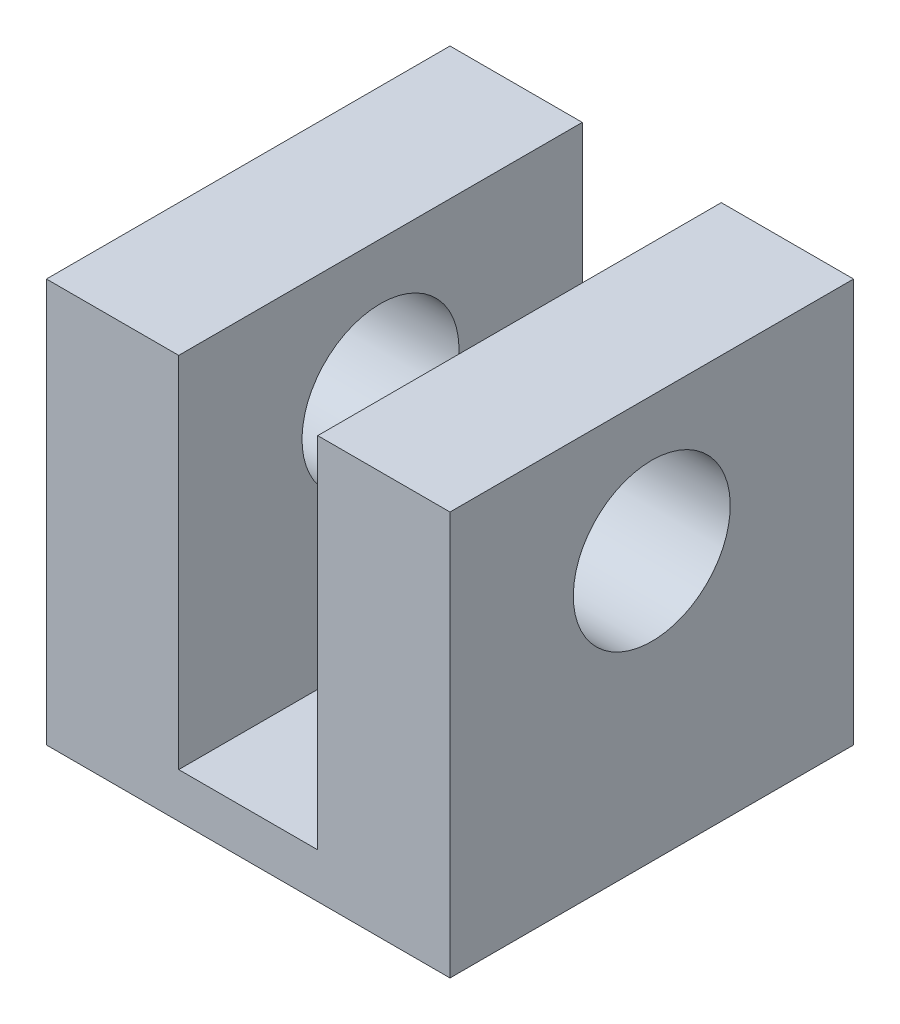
ISO-10303-21;
HEADER;
FILE_DESCRIPTION(('STEP AP214'),'2;1');
FILE_NAME('part.step','',(''),(''),'','','');
FILE_SCHEMA(('AUTOMOTIVE_DESIGN { 1 0 10303 214 1 1 1 1 }'));
ENDSEC;
DATA;
#1=APPLICATION_CONTEXT('core data for automotive mechanical design processes');
#2=APPLICATION_PROTOCOL_DEFINITION('international standard','automotive_design',2000,#1);
#3=PRODUCT_CONTEXT('',#1,'mechanical');
#4=PRODUCT('Part','Part','',(#3));
#5=PRODUCT_RELATED_PRODUCT_CATEGORY('part','',(#4));
#6=PRODUCT_DEFINITION_FORMATION('','',#4);
#7=PRODUCT_DEFINITION_CONTEXT('part definition',#1,'design');
#8=PRODUCT_DEFINITION('design','',#6,#7);
#9=PRODUCT_DEFINITION_SHAPE('','',#8);
#10=(LENGTH_UNIT() NAMED_UNIT(*) SI_UNIT(.MILLI.,.METRE.));
#11=(NAMED_UNIT(*) PLANE_ANGLE_UNIT() SI_UNIT($,.RADIAN.));
#12=(NAMED_UNIT(*) SI_UNIT($,.STERADIAN.) SOLID_ANGLE_UNIT());
#13=UNCERTAINTY_MEASURE_WITH_UNIT(LENGTH_MEASURE(1.E-05),#10,'distance_accuracy_value','');
#14=(GEOMETRIC_REPRESENTATION_CONTEXT(3) GLOBAL_UNCERTAINTY_ASSIGNED_CONTEXT((#13)) GLOBAL_UNIT_ASSIGNED_CONTEXT((#10,
#11,#12)) REPRESENTATION_CONTEXT('',''));
#15=CARTESIAN_POINT('',(0.,0.,0.));
#16=DIRECTION('',(0.,0.,1.));
#17=DIRECTION('',(1.,0.,0.));
#18=AXIS2_PLACEMENT_3D('',#15,#16,#17);
#19=CARTESIAN_POINT('',(-45.,89.9999999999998,90.));
#20=DIRECTION('',(1.,0.,0.));
#21=DIRECTION('',(0.,1.,0.));
#22=AXIS2_PLACEMENT_3D('',#19,#20,#21);
#23=PLANE('',#22);
#24=DIRECTION('',(0.,-1.,0.));
#25=VECTOR('',#24,1.);
#26=CARTESIAN_POINT('',(-45.,89.9999999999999,0.));
#27=LINE('',#26,#25);
#28=CARTESIAN_POINT('',(-45.,89.9999999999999,0.));
#29=VERTEX_POINT('',#28);
#30=CARTESIAN_POINT('',(-45.,0.,0.));
#31=VERTEX_POINT('',#30);
#32=EDGE_CURVE('E132',#29,#31,#27,.T.);
#33=ORIENTED_EDGE('',*,*,#32,.T.);
#34=DIRECTION('',(0.,0.,-1.));
#35=VECTOR('',#34,1.);
#36=CARTESIAN_POINT('',(-45.,0.,90.));
#37=LINE('',#36,#35);
#38=CARTESIAN_POINT('',(-45.,0.,90.));
#39=VERTEX_POINT('',#38);
#40=EDGE_CURVE('E40',#39,#31,#37,.T.);
#41=ORIENTED_EDGE('',*,*,#40,.F.);
#42=DIRECTION('',(0.,-1.,0.));
#43=VECTOR('',#42,1.);
#44=CARTESIAN_POINT('',(-45.,89.9999999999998,90.));
#45=LINE('',#44,#43);
#46=CARTESIAN_POINT('',(-45.,89.9999999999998,90.));
#47=VERTEX_POINT('',#46);
#48=EDGE_CURVE('E91',#47,#39,#45,.T.);
#49=ORIENTED_EDGE('',*,*,#48,.F.);
#50=DIRECTION('',(0.,0.,-1.));
#51=VECTOR('',#50,1.);
#52=CARTESIAN_POINT('',(-45.,89.9999999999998,90.));
#53=LINE('',#52,#51);
#54=EDGE_CURVE('E11',#47,#29,#53,.T.);
#55=ORIENTED_EDGE('',*,*,#54,.T.);
#56=EDGE_LOOP('',(#33,#41,#49,#55));
#57=FACE_BOUND('',#56,.T.);
#58=CARTESIAN_POINT('',(-45.,60.,45.));
#59=DIRECTION('',(1.,0.,0.));
#60=DIRECTION('',(0.,1.,0.));
#61=AXIS2_PLACEMENT_3D('',#58,#59,#60);
#62=CIRCLE('',#61,17.5);
#63=CARTESIAN_POINT('',(-45.,77.4999999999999,45.));
#64=VERTEX_POINT('',#63);
#65=EDGE_CURVE('E133',#64,#64,#62,.F.);
#66=ORIENTED_EDGE('',*,*,#65,.F.);
#67=EDGE_LOOP('',(#66));
#68=FACE_BOUND('',#67,.T.);
#69=ADVANCED_FACE('F30',(#57,#68),#23,.F.);
#70=CARTESIAN_POINT('',(45.,-1.11022302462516E-13,90.));
#71=DIRECTION('',(-1.,0.,0.));
#72=DIRECTION('',(0.,0.,1.));
#73=AXIS2_PLACEMENT_3D('',#70,#71,#72);
#74=PLANE('',#73);
#75=DIRECTION('',(0.,1.,0.));
#76=VECTOR('',#75,1.);
#77=CARTESIAN_POINT('',(45.,0.,0.));
#78=LINE('',#77,#76);
#79=CARTESIAN_POINT('',(45.,0.,0.));
#80=VERTEX_POINT('',#79);
#81=CARTESIAN_POINT('',(45.,89.9999999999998,0.));
#82=VERTEX_POINT('',#81);
#83=EDGE_CURVE('E137',#80,#82,#78,.T.);
#84=ORIENTED_EDGE('',*,*,#83,.T.);
#85=DIRECTION('',(0.,0.,-1.));
#86=VECTOR('',#85,1.);
#87=CARTESIAN_POINT('',(45.,89.9999999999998,90.));
#88=LINE('',#87,#86);
#89=CARTESIAN_POINT('',(45.,89.9999999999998,90.));
#90=VERTEX_POINT('',#89);
#91=EDGE_CURVE('E148',#90,#82,#88,.T.);
#92=ORIENTED_EDGE('',*,*,#91,.F.);
#93=DIRECTION('',(0.,1.,0.));
#94=VECTOR('',#93,1.);
#95=CARTESIAN_POINT('',(45.,-1.11022302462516E-13,90.));
#96=LINE('',#95,#94);
#97=CARTESIAN_POINT('',(45.,-1.11022302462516E-13,90.));
#98=VERTEX_POINT('',#97);
#99=EDGE_CURVE('E173',#98,#90,#96,.T.);
#100=ORIENTED_EDGE('',*,*,#99,.F.);
#101=DIRECTION('',(0.,0.,-1.));
#102=VECTOR('',#101,1.);
#103=CARTESIAN_POINT('',(45.,-1.11022302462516E-13,90.));
#104=LINE('',#103,#102);
#105=EDGE_CURVE('E151',#98,#80,#104,.T.);
#106=ORIENTED_EDGE('',*,*,#105,.T.);
#107=EDGE_LOOP('',(#84,#92,#100,#106));
#108=FACE_BOUND('',#107,.T.);
#109=CARTESIAN_POINT('',(45.,59.9999999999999,45.));
#110=DIRECTION('',(-1.,0.,0.));
#111=DIRECTION('',(0.,-1.,0.));
#112=AXIS2_PLACEMENT_3D('',#109,#110,#111);
#113=CIRCLE('',#112,17.5);
#114=CARTESIAN_POINT('',(45.,77.4999999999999,45.));
#115=VERTEX_POINT('',#114);
#116=EDGE_CURVE('E184',#115,#115,#113,.T.);
#117=ORIENTED_EDGE('',*,*,#116,.T.);
#118=EDGE_LOOP('',(#117));
#119=FACE_BOUND('',#118,.T.);
#120=ADVANCED_FACE('F168',(#108,#119),#74,.F.);
#121=CARTESIAN_POINT('',(15.5,89.9999999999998,90.));
#122=DIRECTION('',(1.,0.,0.));
#123=DIRECTION('',(0.,1.,0.));
#124=AXIS2_PLACEMENT_3D('',#121,#122,#123);
#125=PLANE('',#124);
#126=DIRECTION('',(0.,-1.,0.));
#127=VECTOR('',#126,1.);
#128=CARTESIAN_POINT('',(15.5,89.9999999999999,0.));
#129=LINE('',#128,#127);
#130=CARTESIAN_POINT('',(15.5,89.9999999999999,0.));
#131=VERTEX_POINT('',#130);
#132=CARTESIAN_POINT('',(15.5,10.,0.));
#133=VERTEX_POINT('',#132);
#134=EDGE_CURVE('E119',#131,#133,#129,.T.);
#135=ORIENTED_EDGE('',*,*,#134,.T.);
#136=DIRECTION('',(0.,0.,-1.));
#137=VECTOR('',#136,1.);
#138=CARTESIAN_POINT('',(15.5,9.99999999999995,90.));
#139=LINE('',#138,#137);
#140=CARTESIAN_POINT('',(15.5,9.99999999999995,90.));
#141=VERTEX_POINT('',#140);
#142=EDGE_CURVE('E115',#141,#133,#139,.T.);
#143=ORIENTED_EDGE('',*,*,#142,.F.);
#144=DIRECTION('',(0.,-1.,0.));
#145=VECTOR('',#144,1.);
#146=CARTESIAN_POINT('',(15.5,89.9999999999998,90.));
#147=LINE('',#146,#145);
#148=CARTESIAN_POINT('',(15.5,89.9999999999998,90.));
#149=VERTEX_POINT('',#148);
#150=EDGE_CURVE('E104',#149,#141,#147,.T.);
#151=ORIENTED_EDGE('',*,*,#150,.F.);
#152=DIRECTION('',(0.,0.,-1.));
#153=VECTOR('',#152,1.);
#154=CARTESIAN_POINT('',(15.5,89.9999999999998,90.));
#155=LINE('',#154,#153);
#156=EDGE_CURVE('E120',#149,#131,#155,.T.);
#157=ORIENTED_EDGE('',*,*,#156,.T.);
#158=EDGE_LOOP('',(#135,#143,#151,#157));
#159=FACE_BOUND('',#158,.T.);
#160=CARTESIAN_POINT('',(15.4999999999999,60.,45.));
#161=DIRECTION('',(1.,0.,0.));
#162=DIRECTION('',(0.,1.,0.));
#163=AXIS2_PLACEMENT_3D('',#160,#161,#162);
#164=CIRCLE('',#163,17.5);
#165=CARTESIAN_POINT('',(15.4999999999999,77.4999999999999,45.));
#166=VERTEX_POINT('',#165);
#167=EDGE_CURVE('E181',#166,#166,#164,.F.);
#168=ORIENTED_EDGE('',*,*,#167,.F.);
#169=EDGE_LOOP('',(#168));
#170=FACE_BOUND('',#169,.T.);
#171=ADVANCED_FACE('F116',(#159,#170),#125,.F.);
#172=CARTESIAN_POINT('',(-15.5,9.99999999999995,90.));
#173=DIRECTION('',(-1.,0.,0.));
#174=DIRECTION('',(0.,-1.,0.));
#175=AXIS2_PLACEMENT_3D('',#172,#173,#174);
#176=PLANE('',#175);
#177=DIRECTION('',(0.,1.,0.));
#178=VECTOR('',#177,1.);
#179=CARTESIAN_POINT('',(-15.5,10.,0.));
#180=LINE('',#179,#178);
#181=CARTESIAN_POINT('',(-15.5,10.,0.));
#182=VERTEX_POINT('',#181);
#183=CARTESIAN_POINT('',(-15.5,89.9999999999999,0.));
#184=VERTEX_POINT('',#183);
#185=EDGE_CURVE('E83',#182,#184,#180,.T.);
#186=ORIENTED_EDGE('',*,*,#185,.T.);
#187=DIRECTION('',(0.,0.,-1.));
#188=VECTOR('',#187,1.);
#189=CARTESIAN_POINT('',(-15.5,89.9999999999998,90.));
#190=LINE('',#189,#188);
#191=CARTESIAN_POINT('',(-15.5,89.9999999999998,90.));
#192=VERTEX_POINT('',#191);
#193=EDGE_CURVE('E125',#192,#184,#190,.T.);
#194=ORIENTED_EDGE('',*,*,#193,.F.);
#195=DIRECTION('',(0.,1.,0.));
#196=VECTOR('',#195,1.);
#197=CARTESIAN_POINT('',(-15.5,9.99999999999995,90.));
#198=LINE('',#197,#196);
#199=CARTESIAN_POINT('',(-15.5,9.99999999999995,90.));
#200=VERTEX_POINT('',#199);
#201=EDGE_CURVE('E48',#200,#192,#198,.T.);
#202=ORIENTED_EDGE('',*,*,#201,.F.);
#203=DIRECTION('',(0.,0.,-1.));
#204=VECTOR('',#203,1.);
#205=CARTESIAN_POINT('',(-15.5,9.99999999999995,90.));
#206=LINE('',#205,#204);
#207=EDGE_CURVE('E121',#200,#182,#206,.T.);
#208=ORIENTED_EDGE('',*,*,#207,.T.);
#209=EDGE_LOOP('',(#186,#194,#202,#208));
#210=FACE_BOUND('',#209,.T.);
#211=CARTESIAN_POINT('',(-15.5,60.,45.));
#212=DIRECTION('',(-1.,0.,0.));
#213=DIRECTION('',(0.,-1.,0.));
#214=AXIS2_PLACEMENT_3D('',#211,#212,#213);
#215=CIRCLE('',#214,17.5);
#216=CARTESIAN_POINT('',(-15.5,77.4999999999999,45.));
#217=VERTEX_POINT('',#216);
#218=EDGE_CURVE('E34',#217,#217,#215,.F.);
#219=ORIENTED_EDGE('',*,*,#218,.F.);
#220=EDGE_LOOP('',(#219));
#221=FACE_BOUND('',#220,.T.);
#222=ADVANCED_FACE('F193',(#210,#221),#176,.F.);
#223=CARTESIAN_POINT('',(-15.5,89.9999999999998,90.));
#224=DIRECTION('',(0.,-1.,0.));
#225=DIRECTION('',(1.,0.,0.));
#226=AXIS2_PLACEMENT_3D('',#223,#224,#225);
#227=PLANE('',#226);
#228=DIRECTION('',(-1.,0.,0.));
#229=VECTOR('',#228,1.);
#230=CARTESIAN_POINT('',(-15.5,89.9999999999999,0.));
#231=LINE('',#230,#229);
#232=EDGE_CURVE('E129',#184,#29,#231,.T.);
#233=ORIENTED_EDGE('',*,*,#232,.T.);
#234=ORIENTED_EDGE('',*,*,#54,.F.);
#235=DIRECTION('',(-1.,0.,0.));
#236=VECTOR('',#235,1.);
#237=CARTESIAN_POINT('',(-15.5,89.9999999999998,90.));
#238=LINE('',#237,#236);
#239=EDGE_CURVE('E144',#192,#47,#238,.T.);
#240=ORIENTED_EDGE('',*,*,#239,.F.);
#241=ORIENTED_EDGE('',*,*,#193,.T.);
#242=EDGE_LOOP('',(#233,#234,#240,#241));
#243=FACE_BOUND('',#242,.T.);
#244=ADVANCED_FACE('F32',(#243),#227,.F.);
#245=CARTESIAN_POINT('',(-45.,0.,90.));
#246=DIRECTION('',(0.,1.,0.));
#247=DIRECTION('',(0.,0.,1.));
#248=AXIS2_PLACEMENT_3D('',#245,#246,#247);
#249=PLANE('',#248);
#250=DIRECTION('',(1.,0.,0.));
#251=VECTOR('',#250,1.);
#252=CARTESIAN_POINT('',(-45.,0.,0.));
#253=LINE('',#252,#251);
#254=EDGE_CURVE('E135',#31,#80,#253,.T.);
#255=ORIENTED_EDGE('',*,*,#254,.T.);
#256=ORIENTED_EDGE('',*,*,#105,.F.);
#257=DIRECTION('',(1.,0.,0.));
#258=VECTOR('',#257,1.);
#259=CARTESIAN_POINT('',(-45.,0.,90.));
#260=LINE('',#259,#258);
#261=EDGE_CURVE('E160',#39,#98,#260,.T.);
#262=ORIENTED_EDGE('',*,*,#261,.F.);
#263=ORIENTED_EDGE('',*,*,#40,.T.);
#264=EDGE_LOOP('',(#255,#256,#262,#263));
#265=FACE_BOUND('',#264,.T.);
#266=ADVANCED_FACE('F158',(#265),#249,.F.);
#267=CARTESIAN_POINT('',(45.,89.9999999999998,90.));
#268=DIRECTION('',(0.,-1.,0.));
#269=DIRECTION('',(0.,0.,-1.));
#270=AXIS2_PLACEMENT_3D('',#267,#268,#269);
#271=PLANE('',#270);
#272=DIRECTION('',(-1.,0.,0.));
#273=VECTOR('',#272,1.);
#274=CARTESIAN_POINT('',(45.,89.9999999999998,0.));
#275=LINE('',#274,#273);
#276=EDGE_CURVE('E139',#82,#131,#275,.T.);
#277=ORIENTED_EDGE('',*,*,#276,.T.);
#278=ORIENTED_EDGE('',*,*,#156,.F.);
#279=DIRECTION('',(-1.,0.,0.));
#280=VECTOR('',#279,1.);
#281=CARTESIAN_POINT('',(45.,89.9999999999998,90.));
#282=LINE('',#281,#280);
#283=EDGE_CURVE('E110',#90,#149,#282,.T.);
#284=ORIENTED_EDGE('',*,*,#283,.F.);
#285=ORIENTED_EDGE('',*,*,#91,.T.);
#286=EDGE_LOOP('',(#277,#278,#284,#285));
#287=FACE_BOUND('',#286,.T.);
#288=ADVANCED_FACE('F172',(#287),#271,.F.);
#289=CARTESIAN_POINT('',(15.5,9.99999999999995,90.));
#290=DIRECTION('',(0.,-1.,0.));
#291=DIRECTION('',(1.,0.,0.));
#292=AXIS2_PLACEMENT_3D('',#289,#290,#291);
#293=PLANE('',#292);
#294=DIRECTION('',(-1.,0.,0.));
#295=VECTOR('',#294,1.);
#296=CARTESIAN_POINT('',(15.5,10.,0.));
#297=LINE('',#296,#295);
#298=EDGE_CURVE('E77',#133,#182,#297,.T.);
#299=ORIENTED_EDGE('',*,*,#298,.T.);
#300=ORIENTED_EDGE('',*,*,#207,.F.);
#301=DIRECTION('',(-1.,0.,0.));
#302=VECTOR('',#301,1.);
#303=CARTESIAN_POINT('',(15.5,9.99999999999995,90.));
#304=LINE('',#303,#302);
#305=EDGE_CURVE('E108',#141,#200,#304,.T.);
#306=ORIENTED_EDGE('',*,*,#305,.F.);
#307=ORIENTED_EDGE('',*,*,#142,.T.);
#308=EDGE_LOOP('',(#299,#300,#306,#307));
#309=FACE_BOUND('',#308,.T.);
#310=ADVANCED_FACE('F123',(#309),#293,.F.);
#311=CARTESIAN_POINT('',(-45.,89.9999999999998,90.));
#312=DIRECTION('',(0.,0.,1.));
#313=DIRECTION('',(1.,0.,0.));
#314=AXIS2_PLACEMENT_3D('',#311,#312,#313);
#315=PLANE('',#314);
#316=ORIENTED_EDGE('',*,*,#239,.T.);
#317=ORIENTED_EDGE('',*,*,#48,.T.);
#318=ORIENTED_EDGE('',*,*,#261,.T.);
#319=ORIENTED_EDGE('',*,*,#99,.T.);
#320=ORIENTED_EDGE('',*,*,#283,.T.);
#321=ORIENTED_EDGE('',*,*,#150,.T.);
#322=ORIENTED_EDGE('',*,*,#305,.T.);
#323=ORIENTED_EDGE('',*,*,#201,.T.);
#324=EDGE_LOOP('',(#316,#317,#318,#319,#320,#321,#322,#323));
#325=FACE_BOUND('',#324,.T.);
#326=ADVANCED_FACE('F106',(#325),#315,.T.);
#327=CARTESIAN_POINT('',(-45.,89.9999999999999,0.));
#328=DIRECTION('',(0.,0.,1.));
#329=DIRECTION('',(1.,0.,0.));
#330=AXIS2_PLACEMENT_3D('',#327,#328,#329);
#331=PLANE('',#330);
#332=ORIENTED_EDGE('',*,*,#232,.F.);
#333=ORIENTED_EDGE('',*,*,#185,.F.);
#334=ORIENTED_EDGE('',*,*,#298,.F.);
#335=ORIENTED_EDGE('',*,*,#134,.F.);
#336=ORIENTED_EDGE('',*,*,#276,.F.);
#337=ORIENTED_EDGE('',*,*,#83,.F.);
#338=ORIENTED_EDGE('',*,*,#254,.F.);
#339=ORIENTED_EDGE('',*,*,#32,.F.);
#340=EDGE_LOOP('',(#332,#333,#334,#335,#336,#337,#338,#339));
#341=FACE_BOUND('',#340,.T.);
#342=ADVANCED_FACE('F164',(#341),#331,.F.);
#343=CARTESIAN_POINT('',(-135.,59.9999999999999,45.));
#344=DIRECTION('',(1.,0.,0.));
#345=DIRECTION('',(0.,1.,0.));
#346=AXIS2_PLACEMENT_3D('',#343,#344,#345);
#347=CYLINDRICAL_SURFACE('',#346,17.5);
#348=CARTESIAN_POINT('',(-15.5,77.4999999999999,45.));
#349=CARTESIAN_POINT('',(-15.8072916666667,77.4999999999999,45.));
#350=CARTESIAN_POINT('',(-16.1145833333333,77.4999999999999,45.));
#351=CARTESIAN_POINT('',(-16.7291666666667,77.4999999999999,45.));
#352=CARTESIAN_POINT('',(-17.0364583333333,77.4999999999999,45.));
#353=CARTESIAN_POINT('',(-17.6510416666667,77.4999999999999,45.));
#354=CARTESIAN_POINT('',(-17.9583333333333,77.4999999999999,45.));
#355=CARTESIAN_POINT('',(-18.5729166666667,77.4999999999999,45.));
#356=CARTESIAN_POINT('',(-18.8802083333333,77.4999999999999,45.));
#357=CARTESIAN_POINT('',(-19.4947916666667,77.4999999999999,45.));
#358=CARTESIAN_POINT('',(-19.8020833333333,77.4999999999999,45.));
#359=CARTESIAN_POINT('',(-20.4166666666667,77.4999999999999,45.));
#360=CARTESIAN_POINT('',(-20.7239583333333,77.4999999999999,45.));
#361=CARTESIAN_POINT('',(-21.3385416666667,77.4999999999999,45.));
#362=CARTESIAN_POINT('',(-21.6458333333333,77.4999999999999,45.));
#363=CARTESIAN_POINT('',(-22.2604166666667,77.4999999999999,45.));
#364=CARTESIAN_POINT('',(-22.5677083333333,77.4999999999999,45.));
#365=CARTESIAN_POINT('',(-23.1822916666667,77.4999999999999,45.));
#366=CARTESIAN_POINT('',(-23.4895833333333,77.4999999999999,45.));
#367=CARTESIAN_POINT('',(-24.1041666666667,77.4999999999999,45.));
#368=CARTESIAN_POINT('',(-24.4114583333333,77.4999999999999,45.));
#369=CARTESIAN_POINT('',(-25.0260416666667,77.4999999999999,45.));
#370=CARTESIAN_POINT('',(-25.3333333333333,77.4999999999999,45.));
#371=CARTESIAN_POINT('',(-25.9479166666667,77.4999999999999,45.));
#372=CARTESIAN_POINT('',(-26.2552083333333,77.4999999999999,45.));
#373=CARTESIAN_POINT('',(-26.8697916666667,77.4999999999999,45.));
#374=CARTESIAN_POINT('',(-27.1770833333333,77.4999999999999,45.));
#375=CARTESIAN_POINT('',(-27.7916666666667,77.4999999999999,45.));
#376=CARTESIAN_POINT('',(-28.0989583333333,77.4999999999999,45.));
#377=CARTESIAN_POINT('',(-28.7135416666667,77.4999999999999,45.));
#378=CARTESIAN_POINT('',(-29.0208333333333,77.4999999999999,45.));
#379=CARTESIAN_POINT('',(-29.6354166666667,77.4999999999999,45.));
#380=CARTESIAN_POINT('',(-29.9427083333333,77.4999999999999,45.));
#381=CARTESIAN_POINT('',(-30.5572916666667,77.4999999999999,45.));
#382=CARTESIAN_POINT('',(-30.8645833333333,77.4999999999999,45.));
#383=CARTESIAN_POINT('',(-31.4791666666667,77.4999999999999,45.));
#384=CARTESIAN_POINT('',(-31.7864583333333,77.4999999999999,45.));
#385=CARTESIAN_POINT('',(-32.4010416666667,77.4999999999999,45.));
#386=CARTESIAN_POINT('',(-32.7083333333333,77.4999999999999,45.));
#387=CARTESIAN_POINT('',(-33.3229166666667,77.4999999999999,45.));
#388=CARTESIAN_POINT('',(-33.6302083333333,77.4999999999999,45.));
#389=CARTESIAN_POINT('',(-34.2447916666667,77.4999999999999,45.));
#390=CARTESIAN_POINT('',(-34.5520833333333,77.4999999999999,45.));
#391=CARTESIAN_POINT('',(-35.1666666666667,77.4999999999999,45.));
#392=CARTESIAN_POINT('',(-35.4739583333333,77.4999999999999,45.));
#393=CARTESIAN_POINT('',(-36.0885416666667,77.4999999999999,45.));
#394=CARTESIAN_POINT('',(-36.3958333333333,77.4999999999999,45.));
#395=CARTESIAN_POINT('',(-37.0104166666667,77.4999999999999,45.));
#396=CARTESIAN_POINT('',(-37.3177083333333,77.4999999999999,45.));
#397=CARTESIAN_POINT('',(-37.9322916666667,77.4999999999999,45.));
#398=CARTESIAN_POINT('',(-38.2395833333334,77.4999999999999,45.));
#399=CARTESIAN_POINT('',(-38.8541666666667,77.4999999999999,45.));
#400=CARTESIAN_POINT('',(-39.1614583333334,77.4999999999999,45.));
#401=CARTESIAN_POINT('',(-39.7760416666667,77.4999999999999,45.));
#402=CARTESIAN_POINT('',(-40.0833333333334,77.4999999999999,45.));
#403=CARTESIAN_POINT('',(-40.6979166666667,77.4999999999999,45.));
#404=CARTESIAN_POINT('',(-41.0052083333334,77.4999999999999,45.));
#405=CARTESIAN_POINT('',(-41.6197916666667,77.4999999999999,45.));
#406=CARTESIAN_POINT('',(-41.9270833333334,77.4999999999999,45.));
#407=CARTESIAN_POINT('',(-42.5416666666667,77.4999999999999,45.));
#408=CARTESIAN_POINT('',(-42.8489583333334,77.4999999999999,45.));
#409=CARTESIAN_POINT('',(-43.4635416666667,77.4999999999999,45.));
#410=CARTESIAN_POINT('',(-43.7708333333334,77.4999999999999,45.));
#411=CARTESIAN_POINT('',(-44.3854166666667,77.4999999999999,45.));
#412=CARTESIAN_POINT('',(-44.6927083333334,77.4999999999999,45.));
#413=CARTESIAN_POINT('',(-45.,77.4999999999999,45.));
#414=B_SPLINE_CURVE_WITH_KNOTS('',3,(#348,#349,#350,#351,#352,#353,#354,#355,#356,#357,#358,
#359,#360,#361,#362,#363,#364,#365,#366,#367,#368,#369,#370,#371,#372,#373,#374,#375,#376,#377,
#378,#379,#380,#381,#382,#383,#384,#385,#386,#387,#388,#389,#390,#391,#392,#393,#394,#395,#396,
#397,#398,#399,#400,#401,#402,#403,#404,#405,#406,#407,#408,#409,#410,#411,#412,#413),
.UNSPECIFIED.,.F.,.F.,(4,2,2,2,2,2,2,2,2,2,2,2,2,2,2,2,2,2,2,2,2,2,2,2,2,2,2,2,2,2,2,2,4),(0.,
0.921875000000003,1.84375000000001,2.76562500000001,3.68750000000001,4.609375,5.53125,6.453125,
7.37500000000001,8.29687500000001,9.21875000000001,10.140625,11.0625,11.984375,12.90625,
13.828125,14.75,15.671875,16.59375,17.515625,18.4375,19.359375,20.28125,21.203125,22.125,
23.046875,23.96875,24.890625,25.8125,26.734375,27.65625,28.578125,29.5),.UNSPECIFIED.);
#415=EDGE_CURVE('BSEAM190',#217,#64,#414,.T.);
#416=ORIENTED_EDGE('',*,*,#218,.T.);
#417=ORIENTED_EDGE('',*,*,#65,.T.);
#418=ORIENTED_EDGE('',*,*,#415,.T.);
#419=ORIENTED_EDGE('',*,*,#415,.F.);
#420=EDGE_LOOP('',(#416,#418,#417,#419));
#421=FACE_BOUND('',#420,.T.);
#422=ADVANCED_FACE('F190',(#421),#347,.F.);
#423=CARTESIAN_POINT('',(45.,77.4999999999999,45.));
#424=CARTESIAN_POINT('',(44.6927083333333,77.4999999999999,45.));
#425=CARTESIAN_POINT('',(44.3854166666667,77.4999999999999,45.));
#426=CARTESIAN_POINT('',(43.7708333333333,77.4999999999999,45.));
#427=CARTESIAN_POINT('',(43.4635416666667,77.4999999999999,45.));
#428=CARTESIAN_POINT('',(42.8489583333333,77.4999999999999,45.));
#429=CARTESIAN_POINT('',(42.5416666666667,77.4999999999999,45.));
#430=CARTESIAN_POINT('',(41.9270833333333,77.4999999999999,45.));
#431=CARTESIAN_POINT('',(41.6197916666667,77.4999999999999,45.));
#432=CARTESIAN_POINT('',(41.0052083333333,77.4999999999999,45.));
#433=CARTESIAN_POINT('',(40.6979166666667,77.4999999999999,45.));
#434=CARTESIAN_POINT('',(40.0833333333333,77.4999999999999,45.));
#435=CARTESIAN_POINT('',(39.7760416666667,77.4999999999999,45.));
#436=CARTESIAN_POINT('',(39.1614583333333,77.4999999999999,45.));
#437=CARTESIAN_POINT('',(38.8541666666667,77.4999999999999,45.));
#438=CARTESIAN_POINT('',(38.2395833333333,77.4999999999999,45.));
#439=CARTESIAN_POINT('',(37.9322916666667,77.4999999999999,45.));
#440=CARTESIAN_POINT('',(37.3177083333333,77.4999999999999,45.));
#441=CARTESIAN_POINT('',(37.0104166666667,77.4999999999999,45.));
#442=CARTESIAN_POINT('',(36.3958333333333,77.4999999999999,45.));
#443=CARTESIAN_POINT('',(36.0885416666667,77.4999999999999,45.));
#444=CARTESIAN_POINT('',(35.4739583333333,77.4999999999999,45.));
#445=CARTESIAN_POINT('',(35.1666666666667,77.4999999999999,45.));
#446=CARTESIAN_POINT('',(34.5520833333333,77.4999999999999,45.));
#447=CARTESIAN_POINT('',(34.2447916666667,77.4999999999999,45.));
#448=CARTESIAN_POINT('',(33.6302083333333,77.4999999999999,45.));
#449=CARTESIAN_POINT('',(33.3229166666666,77.4999999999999,45.));
#450=CARTESIAN_POINT('',(32.7083333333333,77.4999999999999,45.));
#451=CARTESIAN_POINT('',(32.4010416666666,77.4999999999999,45.));
#452=CARTESIAN_POINT('',(31.7864583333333,77.4999999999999,45.));
#453=CARTESIAN_POINT('',(31.4791666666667,77.4999999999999,45.));
#454=CARTESIAN_POINT('',(30.8645833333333,77.4999999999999,45.));
#455=CARTESIAN_POINT('',(30.5572916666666,77.4999999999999,45.));
#456=CARTESIAN_POINT('',(29.9427083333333,77.4999999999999,45.));
#457=CARTESIAN_POINT('',(29.6354166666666,77.4999999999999,45.));
#458=CARTESIAN_POINT('',(29.0208333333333,77.4999999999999,45.));
#459=CARTESIAN_POINT('',(28.7135416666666,77.4999999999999,45.));
#460=CARTESIAN_POINT('',(28.0989583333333,77.4999999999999,45.));
#461=CARTESIAN_POINT('',(27.7916666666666,77.4999999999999,45.));
#462=CARTESIAN_POINT('',(27.1770833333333,77.4999999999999,45.));
#463=CARTESIAN_POINT('',(26.8697916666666,77.4999999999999,45.));
#464=CARTESIAN_POINT('',(26.2552083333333,77.4999999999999,45.));
#465=CARTESIAN_POINT('',(25.9479166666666,77.4999999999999,45.));
#466=CARTESIAN_POINT('',(25.3333333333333,77.4999999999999,45.));
#467=CARTESIAN_POINT('',(25.0260416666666,77.4999999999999,45.));
#468=CARTESIAN_POINT('',(24.4114583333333,77.4999999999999,45.));
#469=CARTESIAN_POINT('',(24.1041666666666,77.4999999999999,45.));
#470=CARTESIAN_POINT('',(23.4895833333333,77.4999999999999,45.));
#471=CARTESIAN_POINT('',(23.1822916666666,77.4999999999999,45.));
#472=CARTESIAN_POINT('',(22.5677083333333,77.4999999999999,45.));
#473=CARTESIAN_POINT('',(22.2604166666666,77.4999999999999,45.));
#474=CARTESIAN_POINT('',(21.6458333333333,77.4999999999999,45.));
#475=CARTESIAN_POINT('',(21.3385416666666,77.4999999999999,45.));
#476=CARTESIAN_POINT('',(20.7239583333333,77.4999999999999,45.));
#477=CARTESIAN_POINT('',(20.4166666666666,77.4999999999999,45.));
#478=CARTESIAN_POINT('',(19.8020833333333,77.4999999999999,45.));
#479=CARTESIAN_POINT('',(19.4947916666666,77.4999999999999,45.));
#480=CARTESIAN_POINT('',(18.8802083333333,77.4999999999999,45.));
#481=CARTESIAN_POINT('',(18.5729166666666,77.4999999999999,45.));
#482=CARTESIAN_POINT('',(17.9583333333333,77.4999999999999,45.));
#483=CARTESIAN_POINT('',(17.6510416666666,77.4999999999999,45.));
#484=CARTESIAN_POINT('',(17.0364583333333,77.4999999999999,45.));
#485=CARTESIAN_POINT('',(16.7291666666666,77.4999999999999,45.));
#486=CARTESIAN_POINT('',(16.1145833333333,77.4999999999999,45.));
#487=CARTESIAN_POINT('',(15.8072916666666,77.4999999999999,45.));
#488=CARTESIAN_POINT('',(15.4999999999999,77.4999999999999,45.));
#489=B_SPLINE_CURVE_WITH_KNOTS('',3,(#423,#424,#425,#426,#427,#428,#429,#430,#431,#432,#433,
#434,#435,#436,#437,#438,#439,#440,#441,#442,#443,#444,#445,#446,#447,#448,#449,#450,#451,#452,
#453,#454,#455,#456,#457,#458,#459,#460,#461,#462,#463,#464,#465,#466,#467,#468,#469,#470,#471,
#472,#473,#474,#475,#476,#477,#478,#479,#480,#481,#482,#483,#484,#485,#486,#487,#488),
.UNSPECIFIED.,.F.,.F.,(4,2,2,2,2,2,2,2,2,2,2,2,2,2,2,2,2,2,2,2,2,2,2,2,2,2,2,2,2,2,2,2,4),(0.,
0.921875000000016,1.84375000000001,2.76562499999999,3.68750000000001,4.60937500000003,
5.53125000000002,6.453125,7.37500000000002,8.29687500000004,9.21875000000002,10.140625,11.0625,
11.984375,12.90625,13.828125,14.75,15.6718750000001,16.59375,17.515625,18.4375,19.3593750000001,
20.2812500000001,21.203125,22.1250000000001,23.0468750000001,23.9687500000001,24.8906250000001,
25.8125000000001,26.7343750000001,27.6562500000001,28.5781250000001,29.5000000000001),.UNSPECIFIED.);
#490=EDGE_CURVE('BSEAM224',#115,#166,#489,.T.);
#491=ORIENTED_EDGE('',*,*,#116,.F.);
#492=ORIENTED_EDGE('',*,*,#167,.T.);
#493=ORIENTED_EDGE('',*,*,#490,.T.);
#494=ORIENTED_EDGE('',*,*,#490,.F.);
#495=EDGE_LOOP('',(#491,#493,#492,#494));
#496=FACE_BOUND('',#495,.T.);
#497=ADVANCED_FACE('F224',(#496),#347,.F.);
#498=CLOSED_SHELL('',(#69,#120,#171,#222,#244,#266,#288,#310,#326,#342,#422,#497));
#499=MANIFOLD_SOLID_BREP('B2',#498);
#500=ADVANCED_BREP_SHAPE_REPRESENTATION('',(#18,#499),#14);
#501=SHAPE_DEFINITION_REPRESENTATION(#9,#500);
ENDSEC;
END-ISO-10303-21;
